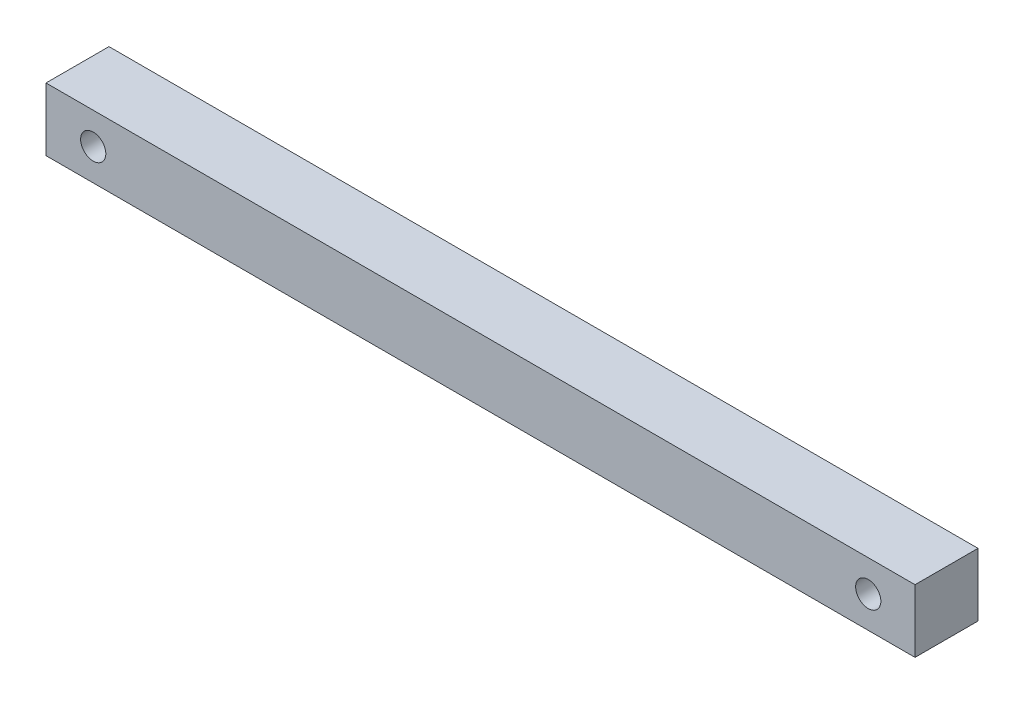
ISO-10303-21;
HEADER;
FILE_DESCRIPTION(('STEP AP214'),'2;1');
FILE_NAME('part.step','',(''),(''),'','','');
FILE_SCHEMA(('AUTOMOTIVE_DESIGN { 1 0 10303 214 1 1 1 1 }'));
ENDSEC;
DATA;
#1=APPLICATION_CONTEXT('core data for automotive mechanical design processes');
#2=APPLICATION_PROTOCOL_DEFINITION('international standard','automotive_design',2000,#1);
#3=PRODUCT_CONTEXT('',#1,'mechanical');
#4=PRODUCT('Part','Part','',(#3));
#5=PRODUCT_RELATED_PRODUCT_CATEGORY('part','',(#4));
#6=PRODUCT_DEFINITION_FORMATION('','',#4);
#7=PRODUCT_DEFINITION_CONTEXT('part definition',#1,'design');
#8=PRODUCT_DEFINITION('design','',#6,#7);
#9=PRODUCT_DEFINITION_SHAPE('','',#8);
#10=(LENGTH_UNIT() NAMED_UNIT(*) SI_UNIT(.MILLI.,.METRE.));
#11=(NAMED_UNIT(*) PLANE_ANGLE_UNIT() SI_UNIT($,.RADIAN.));
#12=(NAMED_UNIT(*) SI_UNIT($,.STERADIAN.) SOLID_ANGLE_UNIT());
#13=UNCERTAINTY_MEASURE_WITH_UNIT(LENGTH_MEASURE(1.E-05),#10,'distance_accuracy_value','');
#14=(GEOMETRIC_REPRESENTATION_CONTEXT(3) GLOBAL_UNCERTAINTY_ASSIGNED_CONTEXT((#13)) GLOBAL_UNIT_ASSIGNED_CONTEXT((#10,
#11,#12)) REPRESENTATION_CONTEXT('',''));
#15=CARTESIAN_POINT('',(0.,0.,0.));
#16=DIRECTION('',(0.,0.,1.));
#17=DIRECTION('',(1.,0.,0.));
#18=AXIS2_PLACEMENT_3D('',#15,#16,#17);
#19=CARTESIAN_POINT('',(-34.,2.5,5.));
#20=DIRECTION('',(1.,0.,0.));
#21=DIRECTION('',(0.,0.,-1.));
#22=AXIS2_PLACEMENT_3D('',#19,#20,#21);
#23=PLANE('',#22);
#24=DIRECTION('',(0.,-1.,0.));
#25=VECTOR('',#24,1.);
#26=CARTESIAN_POINT('',(-34.,2.5,0.));
#27=LINE('',#26,#25);
#28=CARTESIAN_POINT('',(-34.,2.5,0.));
#29=VERTEX_POINT('',#28);
#30=CARTESIAN_POINT('',(-34.,-2.5,0.));
#31=VERTEX_POINT('',#30);
#32=EDGE_CURVE('E98',#29,#31,#27,.T.);
#33=ORIENTED_EDGE('',*,*,#32,.T.);
#34=DIRECTION('',(0.,0.,-1.));
#35=VECTOR('',#34,1.);
#36=CARTESIAN_POINT('',(-34.,-2.5,5.));
#37=LINE('',#36,#35);
#38=CARTESIAN_POINT('',(-34.,-2.5,5.));
#39=VERTEX_POINT('',#38);
#40=EDGE_CURVE('E11',#39,#31,#37,.T.);
#41=ORIENTED_EDGE('',*,*,#40,.F.);
#42=DIRECTION('',(0.,-1.,0.));
#43=VECTOR('',#42,1.);
#44=CARTESIAN_POINT('',(-34.,2.5,5.));
#45=LINE('',#44,#43);
#46=CARTESIAN_POINT('',(-34.,2.5,5.));
#47=VERTEX_POINT('',#46);
#48=EDGE_CURVE('E86',#47,#39,#45,.T.);
#49=ORIENTED_EDGE('',*,*,#48,.F.);
#50=DIRECTION('',(0.,0.,-1.));
#51=VECTOR('',#50,1.);
#52=CARTESIAN_POINT('',(-34.,2.5,5.));
#53=LINE('',#52,#51);
#54=EDGE_CURVE('E94',#47,#29,#53,.T.);
#55=ORIENTED_EDGE('',*,*,#54,.T.);
#56=EDGE_LOOP('',(#33,#41,#49,#55));
#57=FACE_BOUND('',#56,.T.);
#58=ADVANCED_FACE('F35',(#57),#23,.F.);
#59=CARTESIAN_POINT('',(-34.,-2.5,5.));
#60=DIRECTION('',(0.,1.,0.));
#61=DIRECTION('',(0.,0.,1.));
#62=AXIS2_PLACEMENT_3D('',#59,#60,#61);
#63=PLANE('',#62);
#64=DIRECTION('',(1.,0.,0.));
#65=VECTOR('',#64,1.);
#66=CARTESIAN_POINT('',(-34.,-2.5,0.));
#67=LINE('',#66,#65);
#68=CARTESIAN_POINT('',(35.,-2.5,0.));
#69=VERTEX_POINT('',#68);
#70=EDGE_CURVE('E90',#31,#69,#67,.T.);
#71=ORIENTED_EDGE('',*,*,#70,.T.);
#72=DIRECTION('',(0.,0.,-1.));
#73=VECTOR('',#72,1.);
#74=CARTESIAN_POINT('',(35.,-2.5,5.));
#75=LINE('',#74,#73);
#76=CARTESIAN_POINT('',(35.,-2.5,5.));
#77=VERTEX_POINT('',#76);
#78=EDGE_CURVE('E43',#77,#69,#75,.T.);
#79=ORIENTED_EDGE('',*,*,#78,.F.);
#80=DIRECTION('',(1.,0.,0.));
#81=VECTOR('',#80,1.);
#82=CARTESIAN_POINT('',(-34.,-2.5,5.));
#83=LINE('',#82,#81);
#84=EDGE_CURVE('E81',#39,#77,#83,.T.);
#85=ORIENTED_EDGE('',*,*,#84,.F.);
#86=ORIENTED_EDGE('',*,*,#40,.T.);
#87=EDGE_LOOP('',(#71,#79,#85,#86));
#88=FACE_BOUND('',#87,.T.);
#89=ADVANCED_FACE('F89',(#88),#63,.F.);
#90=CARTESIAN_POINT('',(35.,2.5,5.));
#91=DIRECTION('',(-1.,0.,0.));
#92=DIRECTION('',(0.,0.,1.));
#93=AXIS2_PLACEMENT_3D('',#90,#91,#92);
#94=PLANE('',#93);
#95=DIRECTION('',(0.,1.,0.));
#96=VECTOR('',#95,1.);
#97=CARTESIAN_POINT('',(35.,2.5,0.));
#98=LINE('',#97,#96);
#99=CARTESIAN_POINT('',(35.,2.5,0.));
#100=VERTEX_POINT('',#99);
#101=EDGE_CURVE('E68',#69,#100,#98,.T.);
#102=ORIENTED_EDGE('',*,*,#101,.T.);
#103=DIRECTION('',(0.,0.,-1.));
#104=VECTOR('',#103,1.);
#105=CARTESIAN_POINT('',(35.,2.5,5.));
#106=LINE('',#105,#104);
#107=CARTESIAN_POINT('',(35.,2.5,5.));
#108=VERTEX_POINT('',#107);
#109=EDGE_CURVE('E91',#108,#100,#106,.T.);
#110=ORIENTED_EDGE('',*,*,#109,.F.);
#111=DIRECTION('',(0.,1.,0.));
#112=VECTOR('',#111,1.);
#113=CARTESIAN_POINT('',(35.,2.5,5.));
#114=LINE('',#113,#112);
#115=EDGE_CURVE('E84',#77,#108,#114,.T.);
#116=ORIENTED_EDGE('',*,*,#115,.F.);
#117=ORIENTED_EDGE('',*,*,#78,.T.);
#118=EDGE_LOOP('',(#102,#110,#116,#117));
#119=FACE_BOUND('',#118,.T.);
#120=ADVANCED_FACE('F92',(#119),#94,.F.);
#121=CARTESIAN_POINT('',(-34.,2.5,5.));
#122=DIRECTION('',(0.,-1.,0.));
#123=DIRECTION('',(0.,0.,-1.));
#124=AXIS2_PLACEMENT_3D('',#121,#122,#123);
#125=PLANE('',#124);
#126=DIRECTION('',(-1.,0.,0.));
#127=VECTOR('',#126,1.);
#128=CARTESIAN_POINT('',(-34.,2.5,0.));
#129=LINE('',#128,#127);
#130=EDGE_CURVE('E74',#100,#29,#129,.T.);
#131=ORIENTED_EDGE('',*,*,#130,.T.);
#132=ORIENTED_EDGE('',*,*,#54,.F.);
#133=DIRECTION('',(-1.,0.,0.));
#134=VECTOR('',#133,1.);
#135=CARTESIAN_POINT('',(-34.,2.5,5.));
#136=LINE('',#135,#134);
#137=EDGE_CURVE('E51',#108,#47,#136,.T.);
#138=ORIENTED_EDGE('',*,*,#137,.F.);
#139=ORIENTED_EDGE('',*,*,#109,.T.);
#140=EDGE_LOOP('',(#131,#132,#138,#139));
#141=FACE_BOUND('',#140,.T.);
#142=ADVANCED_FACE('F106',(#141),#125,.F.);
#143=CARTESIAN_POINT('',(0.,0.,5.));
#144=DIRECTION('',(0.,0.,1.));
#145=DIRECTION('',(1.,0.,0.));
#146=AXIS2_PLACEMENT_3D('',#143,#144,#145);
#147=PLANE('',#146);
#148=CARTESIAN_POINT('',(31.2850308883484,0.,5.));
#149=DIRECTION('',(0.,0.,1.));
#150=DIRECTION('',(1.,0.,0.));
#151=AXIS2_PLACEMENT_3D('',#148,#149,#150);
#152=CIRCLE('',#151,0.999999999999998);
#153=CARTESIAN_POINT('',(32.2850308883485,0.,5.));
#154=VERTEX_POINT('',#153);
#155=EDGE_CURVE('E118',#154,#154,#152,.T.);
#156=ORIENTED_EDGE('',*,*,#155,.F.);
#157=EDGE_LOOP('',(#156));
#158=FACE_BOUND('',#157,.T.);
#159=CARTESIAN_POINT('',(-30.2512091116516,0.,5.));
#160=DIRECTION('',(0.,0.,1.));
#161=DIRECTION('',(1.,0.,0.));
#162=AXIS2_PLACEMENT_3D('',#159,#160,#161);
#163=CIRCLE('',#162,1.);
#164=CARTESIAN_POINT('',(-29.2512091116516,0.,5.));
#165=VERTEX_POINT('',#164);
#166=EDGE_CURVE('E112',#165,#165,#163,.T.);
#167=ORIENTED_EDGE('',*,*,#166,.F.);
#168=EDGE_LOOP('',(#167));
#169=FACE_BOUND('',#168,.T.);
#170=ORIENTED_EDGE('',*,*,#48,.T.);
#171=ORIENTED_EDGE('',*,*,#84,.T.);
#172=ORIENTED_EDGE('',*,*,#115,.T.);
#173=ORIENTED_EDGE('',*,*,#137,.T.);
#174=EDGE_LOOP('',(#170,#171,#172,#173));
#175=FACE_BOUND('',#174,.T.);
#176=ADVANCED_FACE('F82',(#158,#169,#175),#147,.T.);
#177=CARTESIAN_POINT('',(0.,0.,0.));
#178=DIRECTION('',(0.,0.,1.));
#179=DIRECTION('',(1.,0.,0.));
#180=AXIS2_PLACEMENT_3D('',#177,#178,#179);
#181=PLANE('',#180);
#182=CARTESIAN_POINT('',(31.2850308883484,0.,0.));
#183=DIRECTION('',(0.,0.,1.));
#184=DIRECTION('',(1.,0.,0.));
#185=AXIS2_PLACEMENT_3D('',#182,#183,#184);
#186=CIRCLE('',#185,0.999999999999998);
#187=CARTESIAN_POINT('',(32.2850308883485,0.,0.));
#188=VERTEX_POINT('',#187);
#189=EDGE_CURVE('E115',#188,#188,#186,.T.);
#190=ORIENTED_EDGE('',*,*,#189,.T.);
#191=EDGE_LOOP('',(#190));
#192=FACE_BOUND('',#191,.T.);
#193=CARTESIAN_POINT('',(-30.2512091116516,0.,0.));
#194=DIRECTION('',(0.,0.,1.));
#195=DIRECTION('',(1.,0.,0.));
#196=AXIS2_PLACEMENT_3D('',#193,#194,#195);
#197=CIRCLE('',#196,1.);
#198=CARTESIAN_POINT('',(-29.2512091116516,0.,0.));
#199=VERTEX_POINT('',#198);
#200=EDGE_CURVE('E101',#199,#199,#197,.T.);
#201=ORIENTED_EDGE('',*,*,#200,.T.);
#202=EDGE_LOOP('',(#201));
#203=FACE_BOUND('',#202,.T.);
#204=ORIENTED_EDGE('',*,*,#32,.F.);
#205=ORIENTED_EDGE('',*,*,#130,.F.);
#206=ORIENTED_EDGE('',*,*,#101,.F.);
#207=ORIENTED_EDGE('',*,*,#70,.F.);
#208=EDGE_LOOP('',(#204,#205,#206,#207));
#209=FACE_BOUND('',#208,.T.);
#210=ADVANCED_FACE('F109',(#192,#203,#209),#181,.F.);
#211=CARTESIAN_POINT('',(-30.2512091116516,0.,0.));
#212=DIRECTION('',(0.,0.,1.));
#213=DIRECTION('',(1.,0.,0.));
#214=AXIS2_PLACEMENT_3D('',#211,#212,#213);
#215=CYLINDRICAL_SURFACE('',#214,1.);
#216=ORIENTED_EDGE('',*,*,#200,.F.);
#217=EDGE_LOOP('',(#216));
#218=FACE_BOUND('',#217,.T.);
#219=ORIENTED_EDGE('',*,*,#166,.T.);
#220=EDGE_LOOP('',(#219));
#221=FACE_BOUND('',#220,.T.);
#222=ADVANCED_FACE('F129',(#218,#221),#215,.F.);
#223=CARTESIAN_POINT('',(31.2850308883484,0.,0.));
#224=DIRECTION('',(0.,0.,1.));
#225=DIRECTION('',(1.,0.,0.));
#226=AXIS2_PLACEMENT_3D('',#223,#224,#225);
#227=CYLINDRICAL_SURFACE('',#226,0.999999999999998);
#228=ORIENTED_EDGE('',*,*,#189,.F.);
#229=EDGE_LOOP('',(#228));
#230=FACE_BOUND('',#229,.T.);
#231=ORIENTED_EDGE('',*,*,#155,.T.);
#232=EDGE_LOOP('',(#231));
#233=FACE_BOUND('',#232,.T.);
#234=ADVANCED_FACE('F126',(#230,#233),#227,.F.);
#235=CLOSED_SHELL('',(#58,#89,#120,#142,#176,#210,#222,#234));
#236=MANIFOLD_SOLID_BREP('B2',#235);
#237=ADVANCED_BREP_SHAPE_REPRESENTATION('',(#18,#236),#14);
#238=SHAPE_DEFINITION_REPRESENTATION(#9,#237);
ENDSEC;
END-ISO-10303-21;
